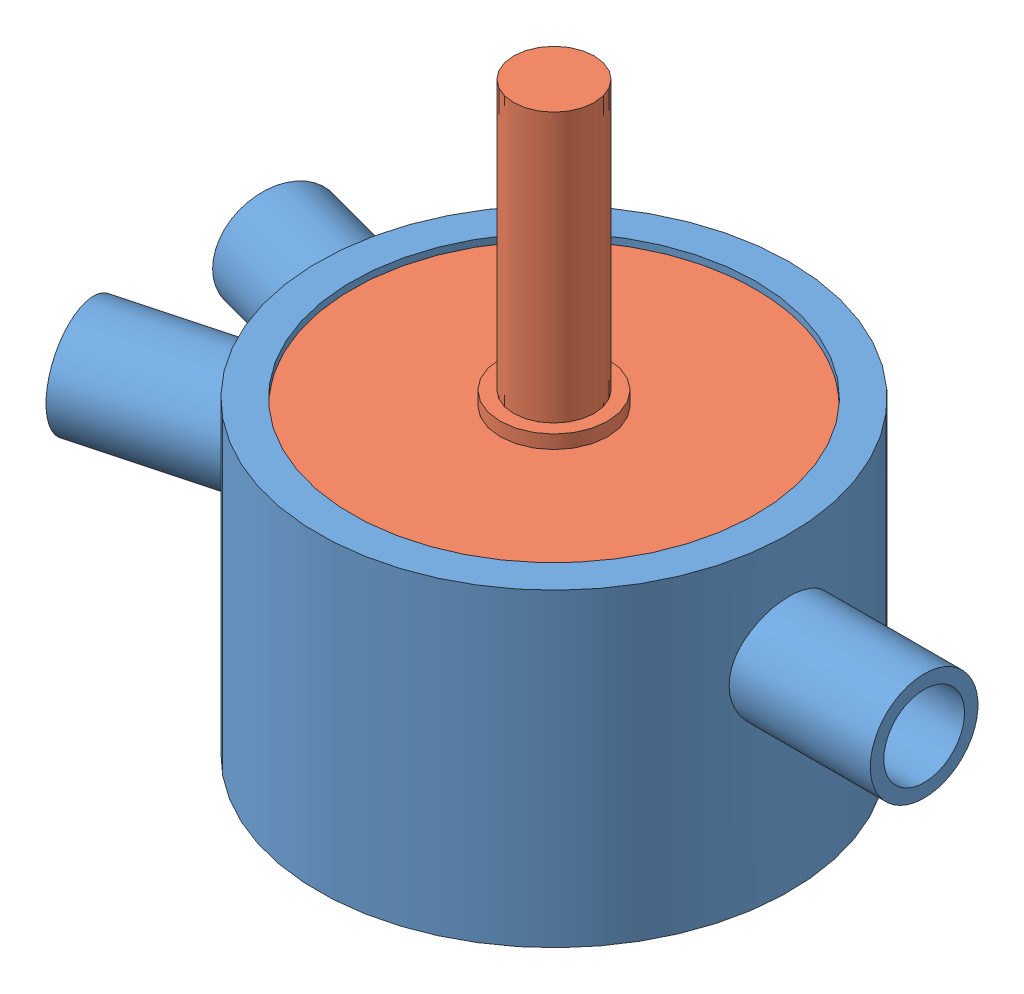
SolidWorks assembly Montagem1.sldasm, configuration Valor predeterminado (file format 8000). Lengths in mm.
Overall size (56.48 43.5 36.77).
2 component instances, 2 part files, 1 mates.
Components (placement in the parent):
- Sede_Inferior_nova-2: Sede_Inferior_nova.SLDPRT [Valor predeterminado<Como usinado>] at (20.3032 -0.5027 56.482) size (56.48 23 35)
- Desviador-2: Desviador.SLDPRT [Valor predeterminado] at (20.3032 -1.0027 56.482) x (-0.965542 0 -0.260246) z (0.260246 0 -0.965542) size (30 41 30)
Mates (geometry in assembly coordinates):
- Articulação1: hinge anti-aligned: cylinder of Desviador-2 through (20.3032 -1.0027 56.482) axis (0 -1 0) radius 3; cylinder of Sede_Inferior_nova-2 through (20.3032 -0.5027 56.482) axis (0 -1 0) radius 3.25; plane of Sede_Inferior_nova-2 through (23.5532 -13.0027 56.482) normal (0 1 0); plane of Desviador-2 through (17.4066 -13.0027 55.7013) normal (0 -1 0)
